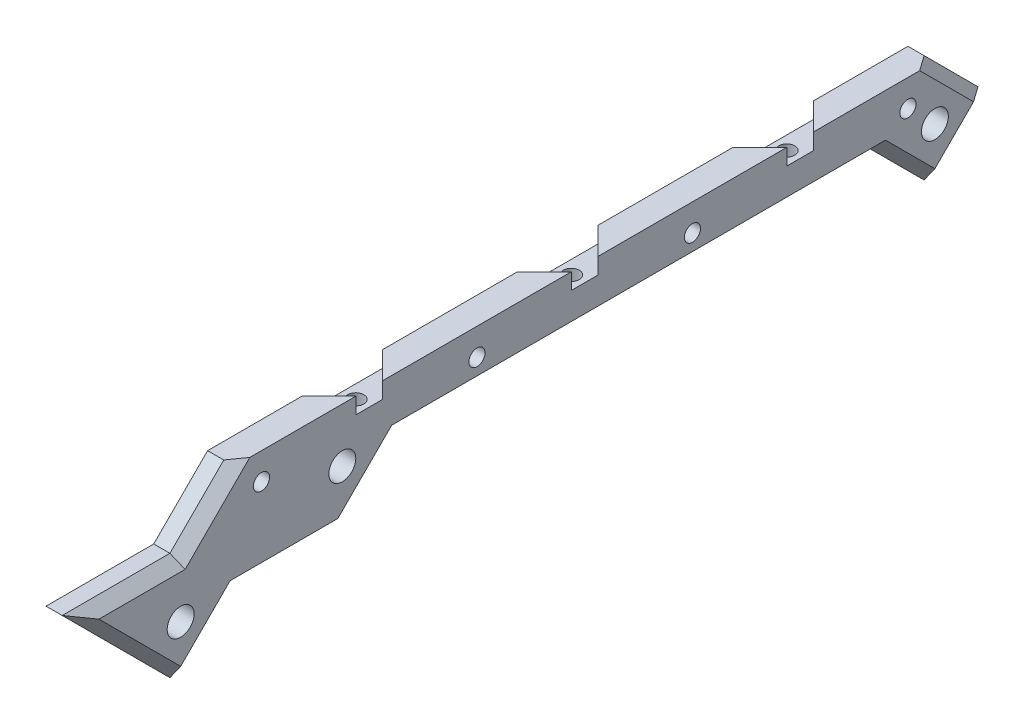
from build123d import *

# Parameters (mm, degrees)
CROQUIS1_R              = 2.5
SALIENTE_EXTRUIR1_DEPTH = 5
CHAFL_N1_SIZE           = 2
CROQUIS2_R              = 1.5
CORTAR_EXTRUIR1_DEPTH   = 98.211110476
CORTAR_EXTRUIR2_DEPTH   = 3
CROQUIS6_R              = 1.5
CORTAR_EXTRUIR3_DEPTH   = 99.888826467


with BuildPart() as part:
    # Croquis1 → Saliente-Extruir1 (new body)
    with BuildSketch(Plane(origin=(0, 0, 0), x_dir=(0, 0, -1), z_dir=(1, 0, 0))):
        Polygon((75, 0), (65, 10), (-65, 10), (-75, 0), (-95, 0), (-75, -20), (-65, -10), (-45, -10), (-35, 0), (55, 0), (65, -10), align=None)
        with Locations((-45, 0)):
            Circle(CROQUIS1_R, mode=Mode.SUBTRACT)
        with Locations((65, 0)):
            Circle(CROQUIS1_R, mode=Mode.SUBTRACT)
        with Locations((-75, -10)):
            Circle(CROQUIS1_R, mode=Mode.SUBTRACT)
    extrude(amount=SALIENTE_EXTRUIR1_DEPTH)

    # Chafl_n1
    chafl_n1_edges = [part.edges().sort_by_distance(p)[0] for p in [
        (5, 5, 70),
        (5, 0, 85),
        (5, -10, 85),
        (5, -15, 70),
        (5, -10, 55),
        (5, -5, 40),
        (5, 0, -10),
        (5, -5, -60),
        (5, -5, -70),
        (5, 5, -70),
    ]]
    chamfer(chafl_n1_edges, length=CHAFL_N1_SIZE)

    # Croquis2 → Cortar-Extruir1 (cut, through all)
    with BuildSketch(Plane(origin=(5, 0, 0), x_dir=(0, 0, -1), z_dir=(1, 0, 0))):
        with Locations((-60, 5)):
            Circle(CROQUIS2_R)
        with Locations((60, 5)):
            Circle(CROQUIS2_R)
        with Locations((-20, 5)):
            Circle(CROQUIS2_R)
        with Locations((20, 5)):
            Circle(CROQUIS2_R)
    extrude(amount=-CORTAR_EXTRUIR1_DEPTH, mode=Mode.SUBTRACT)

    # Croquis5 → Cortar-Extruir2 (cut)
    with BuildSketch(Plane(origin=(0, 10, 0), x_dir=(1, 0, 0), z_dir=(0, 1, 0))):
        Polygon((0, 7.5), (5, 2.5), (5, -2.5), (0, -7.5), align=None)
        Polygon((5, -42.5), (0, -47.5), (0, -32.5), (5, -37.5), align=None)
        Polygon((5, 37.5), (0, 32.5), (0, 47.5), (5, 42.5), align=None)
    extrude(amount=-CORTAR_EXTRUIR2_DEPTH, mode=Mode.SUBTRACT)

    # Croquis6 → Cortar-Extruir3 (cut, through all)
    with BuildSketch(Plane(origin=(0, 7, 0), x_dir=(1, 0, 0), z_dir=(0, 1, 0))):
        with Locations(Location((2.5, 40, 0), (0, 0, 270))):
            Circle(CROQUIS6_R)
        with Locations(Location((2.5, 0, 0), (0, 0, 270))):
            Circle(CROQUIS6_R)
        with Locations(Location((2.5, -40, 0), (0, 0, 270))):
            Circle(CROQUIS6_R)
    extrude(amount=-CORTAR_EXTRUIR3_DEPTH, mode=Mode.SUBTRACT)


solid = part.part
